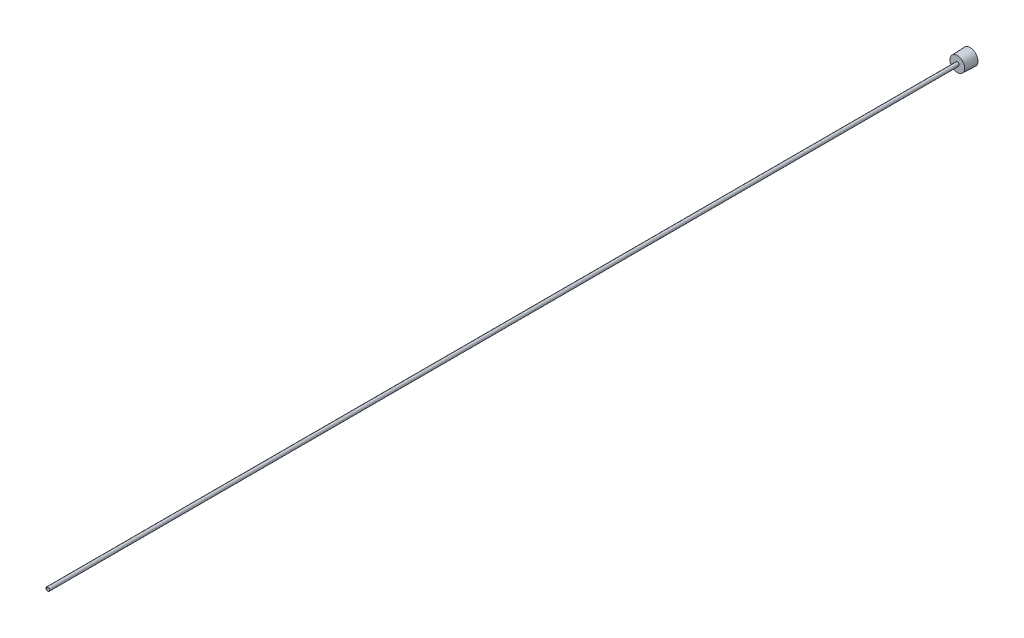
from build123d import *

# Parameters (mm, degrees)
SKETCH2_R          = 0.762
CUT_EXTRUDE1_DEPTH = 458.233247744
CUT_EXTRUDE2_DEPTH = 3.96875


with BuildPart() as part:
    # Sketch1 → Revolve1 (revolve)
    with BuildSketch(Plane(origin=(0, 0, 0), x_dir=(0, 0, -1), z_dir=(1, 0, 0)), mode=Mode.PRIVATE) as revolve1_sk:
        Polygon((-457.2, 0), (0, 0), (0, 3.8989), (-6.35, 3.667387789), (-6.35, 0.9144), (-457.2, 0.9144), align=None)
    revolve(revolve1_sk.sketch.rotate(Axis((0, 0, 0), (0, 0, -1)), 90), axis=Axis((0, 0, 0), (0, 0, -1)))

    # Sketch2 → Cut-Extrude1 (cut, through all)
    with BuildSketch(Plane.XY.offset(457.2)):
        Circle(SKETCH2_R)
    extrude(amount=-CUT_EXTRUDE1_DEPTH, mode=Mode.SUBTRACT)

    # Sketch3 → Cut-Extrude2 (cut)
    with BuildSketch(Plane(origin=(0, 0, 0), x_dir=(-1, 0, 0), z_dir=(0, 0, -1))):
        Polygon((0, -2.749630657), (2.38125, -1.374815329), (2.38125, 1.374815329), (0, 2.749630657), (-2.38125, 1.374815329), (-2.38125, -1.374815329), align=None)
    extrude(amount=-CUT_EXTRUDE2_DEPTH, mode=Mode.SUBTRACT)


solid = part.part
